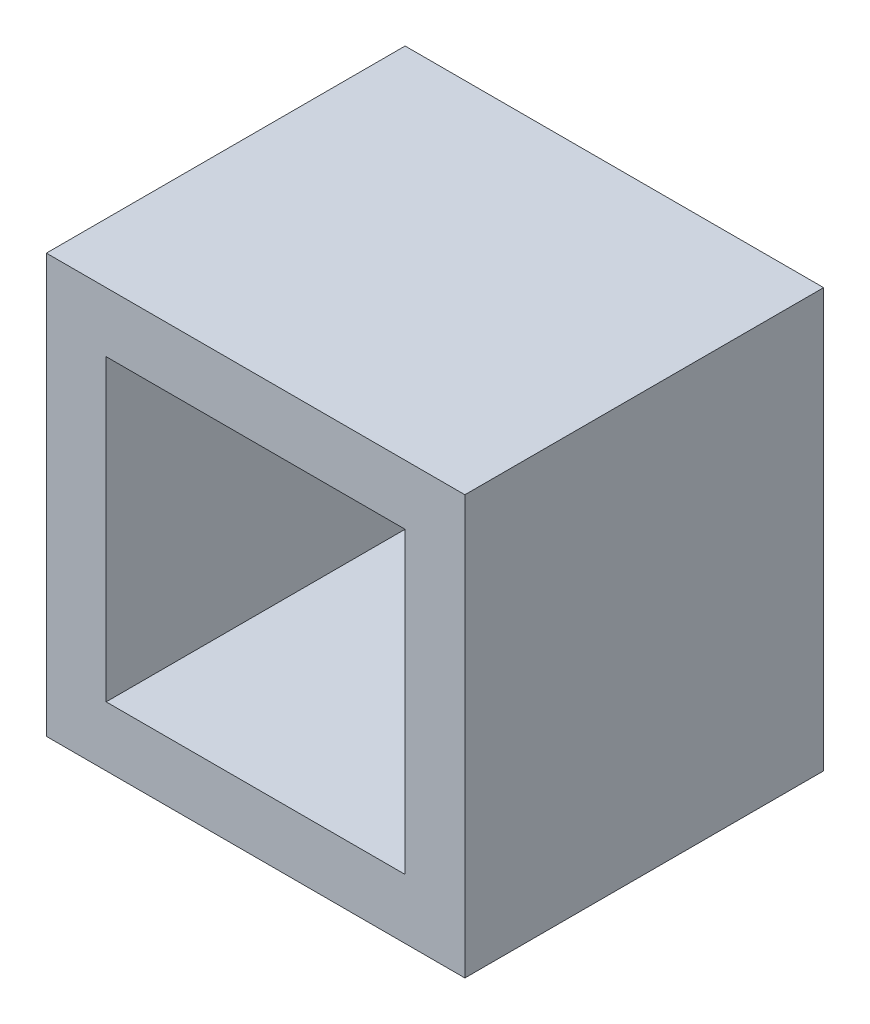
from build123d import *

# Parameters (mm, degrees)
SZKIC1_W                    = 70
SZKIC1_H                    = 70
SZKIC1_W_2                  = 50
SZKIC1_H_2                  = 50
DODANIE_WYCI_GNI_CIE1_DEPTH = 60


with BuildPart() as part:
    # Szkic1 → Dodanie-wyci_gni_cie1 (new body)
    with BuildSketch(Plane.XY):
        Rectangle(SZKIC1_W, SZKIC1_H)
        Rectangle(SZKIC1_W_2, SZKIC1_H_2, mode=Mode.SUBTRACT)
    extrude(amount=DODANIE_WYCI_GNI_CIE1_DEPTH)


solid = part.part
